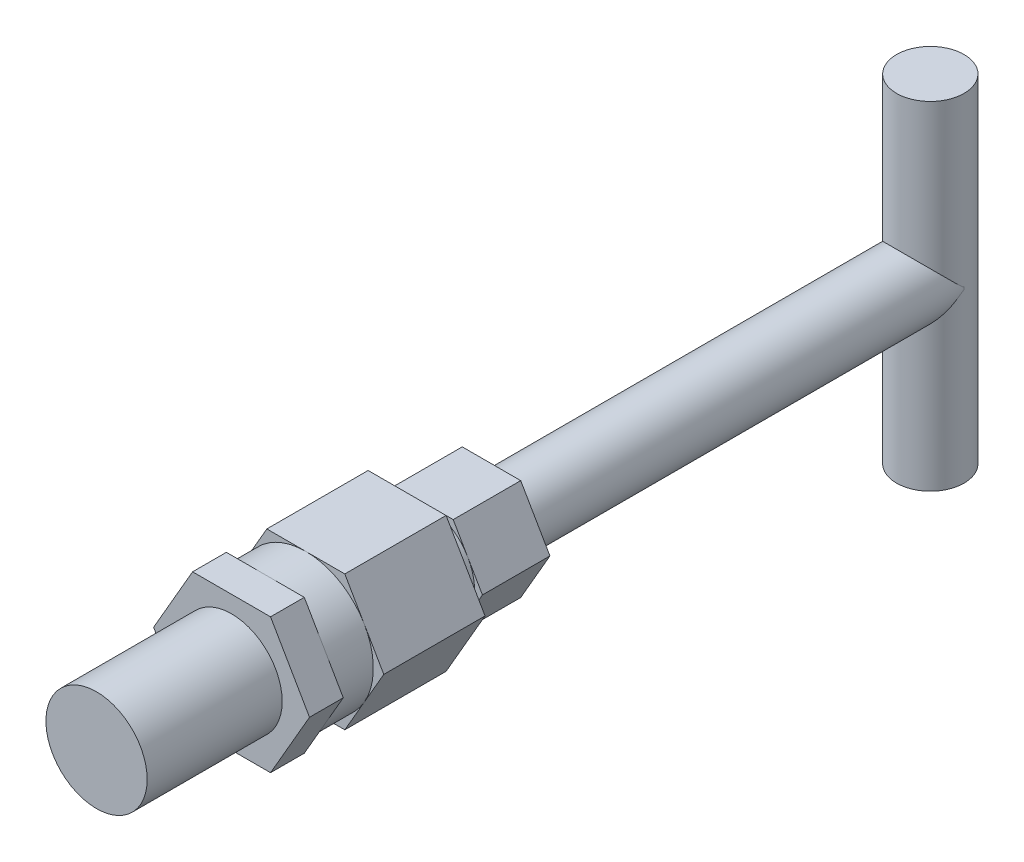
ISO-10303-21;
HEADER;
FILE_DESCRIPTION(('STEP AP214'),'2;1');
FILE_NAME('part.step','',(''),(''),'','','');
FILE_SCHEMA(('AUTOMOTIVE_DESIGN { 1 0 10303 214 1 1 1 1 }'));
ENDSEC;
DATA;
#1=APPLICATION_CONTEXT('core data for automotive mechanical design processes');
#2=APPLICATION_PROTOCOL_DEFINITION('international standard','automotive_design',2000,#1);
#3=PRODUCT_CONTEXT('',#1,'mechanical');
#4=PRODUCT('Part','Part','',(#3));
#5=PRODUCT_RELATED_PRODUCT_CATEGORY('part','',(#4));
#6=PRODUCT_DEFINITION_FORMATION('','',#4);
#7=PRODUCT_DEFINITION_CONTEXT('part definition',#1,'design');
#8=PRODUCT_DEFINITION('design','',#6,#7);
#9=PRODUCT_DEFINITION_SHAPE('','',#8);
#10=(LENGTH_UNIT() NAMED_UNIT(*) SI_UNIT(.MILLI.,.METRE.));
#11=(NAMED_UNIT(*) PLANE_ANGLE_UNIT() SI_UNIT($,.RADIAN.));
#12=(NAMED_UNIT(*) SI_UNIT($,.STERADIAN.) SOLID_ANGLE_UNIT());
#13=UNCERTAINTY_MEASURE_WITH_UNIT(LENGTH_MEASURE(1.E-05),#10,'distance_accuracy_value','');
#14=(GEOMETRIC_REPRESENTATION_CONTEXT(3) GLOBAL_UNCERTAINTY_ASSIGNED_CONTEXT((#13)) GLOBAL_UNIT_ASSIGNED_CONTEXT((#10,
#11,#12)) REPRESENTATION_CONTEXT('',''));
#15=CARTESIAN_POINT('',(0.,0.,0.));
#16=DIRECTION('',(0.,0.,1.));
#17=DIRECTION('',(1.,0.,0.));
#18=AXIS2_PLACEMENT_3D('',#15,#16,#17);
#19=CARTESIAN_POINT('',(0.,0.,-34.));
#20=DIRECTION('',(0.,0.,1.));
#21=DIRECTION('',(1.,0.,0.));
#22=AXIS2_PLACEMENT_3D('',#19,#20,#21);
#23=CYLINDRICAL_SURFACE('',#22,2.);
#24=CARTESIAN_POINT('',(0.,0.,-8.));
#25=DIRECTION('',(0.,0.,-1.));
#26=DIRECTION('',(-1.,0.,0.));
#27=AXIS2_PLACEMENT_3D('',#24,#25,#26);
#28=CIRCLE('',#27,2.);
#29=CARTESIAN_POINT('',(-2.,0.,-8.));
#30=VERTEX_POINT('',#29);
#31=EDGE_CURVE('E234',#30,#30,#28,.T.);
#32=ORIENTED_EDGE('',*,*,#31,.T.);
#33=EDGE_LOOP('',(#32));
#34=FACE_BOUND('',#33,.T.);
#35=CARTESIAN_POINT('',(-1.99809491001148,0.0872738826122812,-34.));
#36=CARTESIAN_POINT('',(-1.9980958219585,0.0872323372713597,-33.9934277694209));
#37=CARTESIAN_POINT('',(-1.9980626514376,0.088014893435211,-33.9869364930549));
#38=CARTESIAN_POINT('',(-1.99793984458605,0.0907699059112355,-33.9743696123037));
#39=CARTESIAN_POINT('',(-1.99785164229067,0.0927120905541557,-33.9682876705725));
#40=CARTESIAN_POINT('',(-1.9974877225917,0.100339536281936,-33.9489046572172));
#41=CARTESIAN_POINT('',(-1.99711635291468,0.107638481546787,-33.9362962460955));
#42=CARTESIAN_POINT('',(-1.99618551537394,0.123749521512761,-33.9118049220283));
#43=CARTESIAN_POINT('',(-1.99562174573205,0.132593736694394,-33.8999466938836));
#44=CARTESIAN_POINT('',(-1.99350688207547,0.162323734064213,-33.8621383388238));
#45=CARTESIAN_POINT('',(-1.99160383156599,0.184411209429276,-33.8371499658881));
#46=CARTESIAN_POINT('',(-1.9869510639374,0.229232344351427,-33.787838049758));
#47=CARTESIAN_POINT('',(-1.98419994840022,0.251967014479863,-33.7635156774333));
#48=CARTESIAN_POINT('',(-1.97788220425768,0.29749193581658,-33.7154870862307));
#49=CARTESIAN_POINT('',(-1.97432419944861,0.320279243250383,-33.6917771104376));
#50=CARTESIAN_POINT('',(-1.9663776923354,0.365919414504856,-33.6445952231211));
#51=CARTESIAN_POINT('',(-1.96198967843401,0.388772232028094,-33.6211231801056));
#52=CARTESIAN_POINT('',(-1.94237848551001,0.482009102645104,-33.5256953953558));
#53=CARTESIAN_POINT('',(-1.92360066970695,0.552399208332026,-33.4544311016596));
#54=CARTESIAN_POINT('',(-1.87787446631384,0.69210343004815,-33.3133676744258));
#55=CARTESIAN_POINT('',(-1.85091893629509,0.761416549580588,-33.2435698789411));
#56=CARTESIAN_POINT('',(-1.78842588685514,0.89845371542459,-33.1057628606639));
#57=CARTESIAN_POINT('',(-1.75286113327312,0.966171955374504,-33.0377600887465));
#58=CARTESIAN_POINT('',(-1.67283034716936,1.09892801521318,-32.904529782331));
#59=CARTESIAN_POINT('',(-1.62837120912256,1.16396786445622,-32.8393001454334));
#60=CARTESIAN_POINT('',(-1.51885898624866,1.30489360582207,-32.6980160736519));
#61=CARTESIAN_POINT('',(-1.45142177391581,1.37987851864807,-32.6228772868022));
#62=CARTESIAN_POINT('',(-1.30165997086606,1.52193832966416,-32.4805602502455));
#63=CARTESIAN_POINT('',(-1.21936913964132,1.58903060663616,-32.4133645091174));
#64=CARTESIAN_POINT('',(-1.05688138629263,1.70021379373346,-32.3020255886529));
#65=CARTESIAN_POINT('',(-0.979360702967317,1.74624335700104,-32.255937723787));
#66=CARTESIAN_POINT('',(-0.81473886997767,1.82883801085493,-32.1732444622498));
#67=CARTESIAN_POINT('',(-0.727648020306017,1.8654131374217,-32.1366290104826));
#68=CARTESIAN_POINT('',(-0.560765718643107,1.92143940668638,-32.0805432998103));
#69=CARTESIAN_POINT('',(-0.482222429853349,1.94273866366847,-32.0592224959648));
#70=CARTESIAN_POINT('',(-0.321186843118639,1.97574746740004,-32.0261808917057));
#71=CARTESIAN_POINT('',(-0.238697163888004,1.98746328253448,-32.0144538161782));
#72=CARTESIAN_POINT('',(-0.0717971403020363,2.00046767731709,-32.0014369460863));
#73=CARTESIAN_POINT('',(0.0126185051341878,2.00172277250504,-32.0001806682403));
#74=CARTESIAN_POINT('',(0.180419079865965,1.99361657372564,-32.0082946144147));
#75=CARTESIAN_POINT('',(0.263803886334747,1.98425402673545,-32.0176660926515));
#76=CARTESIAN_POINT('',(0.423167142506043,1.95631513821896,-32.0456324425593));
#77=CARTESIAN_POINT('',(0.499309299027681,1.93819674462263,-32.0637688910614));
#78=CARTESIAN_POINT('',(0.646834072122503,1.89408134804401,-32.1079301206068));
#79=CARTESIAN_POINT('',(0.718215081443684,1.8680817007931,-32.1339575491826));
#80=CARTESIAN_POINT('',(0.88167117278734,1.7981402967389,-32.2039778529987));
#81=CARTESIAN_POINT('',(0.971131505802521,1.75114471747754,-32.2510294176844));
#82=CARTESIAN_POINT('',(1.13813777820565,1.64752903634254,-32.3547819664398));
#83=CARTESIAN_POINT('',(1.21565510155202,1.59088648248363,-32.4115054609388));
#84=CARTESIAN_POINT('',(1.38552702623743,1.44804043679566,-32.5545842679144));
#85=CARTESIAN_POINT('',(1.47257905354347,1.35870673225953,-32.6440849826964));
#86=CARTESIAN_POINT('',(1.62538524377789,1.17163261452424,-32.8316031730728));
#87=CARTESIAN_POINT('',(1.69114138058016,1.07389298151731,-32.9296198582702));
#88=CARTESIAN_POINT('',(1.77976191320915,0.914853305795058,-33.0893044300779));
#89=CARTESIAN_POINT('',(1.80910519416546,0.855250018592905,-33.1491902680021));
#90=CARTESIAN_POINT('',(1.86133549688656,0.734676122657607,-33.2704938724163));
#91=CARTESIAN_POINT('',(1.88421813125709,0.673704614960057,-33.3319126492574));
#92=CARTESIAN_POINT('',(1.91704290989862,0.571641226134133,-33.4350305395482));
#93=CARTESIAN_POINT('',(1.92874754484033,0.530771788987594,-33.4764025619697));
#94=CARTESIAN_POINT('',(1.9493770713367,0.449100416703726,-33.5593969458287));
#95=CARTESIAN_POINT('',(1.95831834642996,0.408299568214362,-33.6010162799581));
#96=CARTESIAN_POINT('',(1.97043305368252,0.343499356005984,-33.6677183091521));
#97=CARTESIAN_POINT('',(1.97446967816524,0.319454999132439,-33.6926006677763));
#98=CARTESIAN_POINT('',(1.98168535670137,0.271169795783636,-33.7431559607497));
#99=CARTESIAN_POINT('',(1.98484765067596,0.246933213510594,-33.7688350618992));
#100=CARTESIAN_POINT('',(1.99028429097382,0.198404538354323,-33.821457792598));
#101=CARTESIAN_POINT('',(1.99253583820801,0.174124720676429,-33.8484169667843));
#102=CARTESIAN_POINT('',(1.99510716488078,0.140259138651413,-33.8899478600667));
#103=CARTESIAN_POINT('',(1.99582231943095,0.12960609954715,-33.903658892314));
#104=CARTESIAN_POINT('',(1.99699610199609,0.109979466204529,-33.9322249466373));
#105=CARTESIAN_POINT('',(1.99745799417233,0.100985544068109,-33.9470624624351));
#106=CARTESIAN_POINT('',(1.99780710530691,0.0936400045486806,-33.9659674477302));
#107=CARTESIAN_POINT('',(1.99785534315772,0.0926010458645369,-33.9689166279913));
#108=CARTESIAN_POINT('',(1.99793937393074,0.0907690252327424,-33.9748903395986));
#109=CARTESIAN_POINT('',(1.99797517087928,0.089975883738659,-33.9779148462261));
#110=CARTESIAN_POINT('',(1.99806375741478,0.0879940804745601,-33.9872104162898));
#111=CARTESIAN_POINT('',(1.99809531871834,0.0872559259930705,-33.9935769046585));
#112=CARTESIAN_POINT('',(1.99809491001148,0.0872738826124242,-34.0000000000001));
#113=B_SPLINE_CURVE_WITH_KNOTS('',3,(#35,#36,#37,#38,#39,#40,#41,#42,#43,#44,#45,#46,#47,#48,
#49,#50,#51,#52,#53,#54,#55,#56,#57,#58,#59,#60,#61,#62,#63,#64,#65,#66,#67,#68,#69,#70,#71,#72,
#73,#74,#75,#76,#77,#78,#79,#80,#81,#82,#83,#84,#85,#86,#87,#88,#89,#90,#91,#92,#93,#94,#95,#96,
#97,#98,#99,#100,#101,#102,#103,#104,#105,#106,#107,#108,#109,#110,#111,#112),.UNSPECIFIED.,.F.,
.F.,(4,2,2,2,2,2,2,2,2,2,2,2,2,2,2,2,2,2,2,2,2,2,2,2,2,2,2,2,2,2,2,2,2,2,2,2,2,2,4),(0.,
0.0195438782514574,0.0385986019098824,0.0819712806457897,0.126385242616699,0.226453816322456,
0.326688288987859,0.425898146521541,0.525049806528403,0.830412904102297,1.13604347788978,
1.4426538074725,1.7490273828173,2.12513746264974,2.50040323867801,2.80305185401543,
3.10537787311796,3.35668790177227,3.60783342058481,3.85978254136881,4.11176139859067,
4.35179200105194,4.59190322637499,4.92446790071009,5.25781742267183,5.71590842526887,
6.17395695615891,6.44205919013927,6.71034305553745,6.888248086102,7.06507716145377,
7.16956599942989,7.27593729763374,7.38482739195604,7.43700845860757,7.48850015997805,
7.49787146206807,7.50723972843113,7.52638070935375),.UNSPECIFIED.);
#114=CARTESIAN_POINT('',(-1.99809491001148,0.0872738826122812,-34.));
#115=VERTEX_POINT('',#114);
#116=CARTESIAN_POINT('',(1.99809491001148,0.0872738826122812,-34.));
#117=VERTEX_POINT('',#116);
#118=EDGE_CURVE('E227',#115,#117,#113,.T.);
#119=ORIENTED_EDGE('',*,*,#118,.F.);
#120=CARTESIAN_POINT('',(-1.99809491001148,-0.0872738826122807,-34.));
#121=DIRECTION('',(0.,1.,0.));
#122=VECTOR('',#121,1.);
#123=LINE('',#120,#122);
#124=CARTESIAN_POINT('',(-1.99809491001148,-0.0872738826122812,-34.));
#125=VERTEX_POINT('',#124);
#126=EDGE_CURVE('E49',#125,#115,#123,.T.);
#127=ORIENTED_EDGE('',*,*,#126,.F.);
#128=CARTESIAN_POINT('',(1.99809491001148,-0.0872738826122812,-34.));
#129=CARTESIAN_POINT('',(1.9980958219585,-0.0872323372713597,-33.9934277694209));
#130=CARTESIAN_POINT('',(1.9980626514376,-0.088014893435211,-33.9869364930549));
#131=CARTESIAN_POINT('',(1.99793984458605,-0.0907699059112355,-33.9743696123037));
#132=CARTESIAN_POINT('',(1.99785164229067,-0.0927120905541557,-33.9682876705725));
#133=CARTESIAN_POINT('',(1.9974877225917,-0.100339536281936,-33.9489046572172));
#134=CARTESIAN_POINT('',(1.99711635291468,-0.107638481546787,-33.9362962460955));
#135=CARTESIAN_POINT('',(1.99618551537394,-0.123749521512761,-33.9118049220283));
#136=CARTESIAN_POINT('',(1.99562174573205,-0.132593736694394,-33.8999466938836));
#137=CARTESIAN_POINT('',(1.99350688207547,-0.162323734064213,-33.8621383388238));
#138=CARTESIAN_POINT('',(1.99160383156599,-0.184411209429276,-33.8371499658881));
#139=CARTESIAN_POINT('',(1.9869510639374,-0.229232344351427,-33.787838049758));
#140=CARTESIAN_POINT('',(1.98419994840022,-0.251967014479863,-33.7635156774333));
#141=CARTESIAN_POINT('',(1.97788220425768,-0.29749193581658,-33.7154870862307));
#142=CARTESIAN_POINT('',(1.97432419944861,-0.320279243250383,-33.6917771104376));
#143=CARTESIAN_POINT('',(1.9663776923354,-0.365919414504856,-33.6445952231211));
#144=CARTESIAN_POINT('',(1.96198967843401,-0.388772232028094,-33.6211231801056));
#145=CARTESIAN_POINT('',(1.94237848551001,-0.482009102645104,-33.5256953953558));
#146=CARTESIAN_POINT('',(1.92360066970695,-0.552399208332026,-33.4544311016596));
#147=CARTESIAN_POINT('',(1.87787446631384,-0.69210343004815,-33.3133676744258));
#148=CARTESIAN_POINT('',(1.85091893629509,-0.761416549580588,-33.2435698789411));
#149=CARTESIAN_POINT('',(1.78842588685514,-0.89845371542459,-33.1057628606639));
#150=CARTESIAN_POINT('',(1.75286113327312,-0.966171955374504,-33.0377600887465));
#151=CARTESIAN_POINT('',(1.67283034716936,-1.09892801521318,-32.904529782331));
#152=CARTESIAN_POINT('',(1.62837120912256,-1.16396786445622,-32.8393001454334));
#153=CARTESIAN_POINT('',(1.51885898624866,-1.30489360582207,-32.6980160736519));
#154=CARTESIAN_POINT('',(1.45142177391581,-1.37987851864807,-32.6228772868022));
#155=CARTESIAN_POINT('',(1.30165997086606,-1.52193832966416,-32.4805602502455));
#156=CARTESIAN_POINT('',(1.21936913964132,-1.58903060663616,-32.4133645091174));
#157=CARTESIAN_POINT('',(1.05688138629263,-1.70021379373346,-32.3020255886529));
#158=CARTESIAN_POINT('',(0.979360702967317,-1.74624335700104,-32.255937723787));
#159=CARTESIAN_POINT('',(0.81473886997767,-1.82883801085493,-32.1732444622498));
#160=CARTESIAN_POINT('',(0.727648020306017,-1.8654131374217,-32.1366290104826));
#161=CARTESIAN_POINT('',(0.560765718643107,-1.92143940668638,-32.0805432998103));
#162=CARTESIAN_POINT('',(0.482222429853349,-1.94273866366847,-32.0592224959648));
#163=CARTESIAN_POINT('',(0.321186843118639,-1.97574746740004,-32.0261808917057));
#164=CARTESIAN_POINT('',(0.238697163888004,-1.98746328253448,-32.0144538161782));
#165=CARTESIAN_POINT('',(0.0717971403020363,-2.00046767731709,-32.0014369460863));
#166=CARTESIAN_POINT('',(-0.0126185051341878,-2.00172277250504,-32.0001806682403));
#167=CARTESIAN_POINT('',(-0.180419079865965,-1.99361657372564,-32.0082946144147));
#168=CARTESIAN_POINT('',(-0.263803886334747,-1.98425402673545,-32.0176660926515));
#169=CARTESIAN_POINT('',(-0.423167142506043,-1.95631513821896,-32.0456324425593));
#170=CARTESIAN_POINT('',(-0.499309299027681,-1.93819674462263,-32.0637688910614));
#171=CARTESIAN_POINT('',(-0.646834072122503,-1.89408134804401,-32.1079301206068));
#172=CARTESIAN_POINT('',(-0.718215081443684,-1.8680817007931,-32.1339575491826));
#173=CARTESIAN_POINT('',(-0.88167117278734,-1.7981402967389,-32.2039778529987));
#174=CARTESIAN_POINT('',(-0.971131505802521,-1.75114471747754,-32.2510294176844));
#175=CARTESIAN_POINT('',(-1.13813777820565,-1.64752903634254,-32.3547819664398));
#176=CARTESIAN_POINT('',(-1.21565510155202,-1.59088648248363,-32.4115054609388));
#177=CARTESIAN_POINT('',(-1.38552702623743,-1.44804043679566,-32.5545842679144));
#178=CARTESIAN_POINT('',(-1.47257905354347,-1.35870673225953,-32.6440849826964));
#179=CARTESIAN_POINT('',(-1.62538524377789,-1.17163261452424,-32.8316031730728));
#180=CARTESIAN_POINT('',(-1.69114138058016,-1.07389298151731,-32.9296198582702));
#181=CARTESIAN_POINT('',(-1.77976191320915,-0.914853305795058,-33.0893044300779));
#182=CARTESIAN_POINT('',(-1.80910519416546,-0.855250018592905,-33.1491902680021));
#183=CARTESIAN_POINT('',(-1.86133549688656,-0.734676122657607,-33.2704938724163));
#184=CARTESIAN_POINT('',(-1.88421813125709,-0.673704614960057,-33.3319126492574));
#185=CARTESIAN_POINT('',(-1.91704290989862,-0.571641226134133,-33.4350305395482));
#186=CARTESIAN_POINT('',(-1.92874754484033,-0.530771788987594,-33.4764025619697));
#187=CARTESIAN_POINT('',(-1.9493770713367,-0.449100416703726,-33.5593969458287));
#188=CARTESIAN_POINT('',(-1.95831834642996,-0.408299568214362,-33.6010162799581));
#189=CARTESIAN_POINT('',(-1.97043305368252,-0.343499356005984,-33.6677183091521));
#190=CARTESIAN_POINT('',(-1.97446967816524,-0.319454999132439,-33.6926006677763));
#191=CARTESIAN_POINT('',(-1.98168535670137,-0.271169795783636,-33.7431559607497));
#192=CARTESIAN_POINT('',(-1.98484765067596,-0.246933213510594,-33.7688350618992));
#193=CARTESIAN_POINT('',(-1.99028429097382,-0.198404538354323,-33.821457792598));
#194=CARTESIAN_POINT('',(-1.99253583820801,-0.174124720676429,-33.8484169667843));
#195=CARTESIAN_POINT('',(-1.99510716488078,-0.140259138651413,-33.8899478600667));
#196=CARTESIAN_POINT('',(-1.99582231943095,-0.12960609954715,-33.903658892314));
#197=CARTESIAN_POINT('',(-1.99699610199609,-0.109979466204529,-33.9322249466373));
#198=CARTESIAN_POINT('',(-1.99745799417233,-0.100985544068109,-33.9470624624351));
#199=CARTESIAN_POINT('',(-1.99780710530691,-0.0936400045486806,-33.9659674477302));
#200=CARTESIAN_POINT('',(-1.99785534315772,-0.0926010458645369,-33.9689166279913));
#201=CARTESIAN_POINT('',(-1.99793937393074,-0.0907690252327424,-33.9748903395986));
#202=CARTESIAN_POINT('',(-1.99797517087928,-0.089975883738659,-33.9779148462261));
#203=CARTESIAN_POINT('',(-1.99806375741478,-0.0879940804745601,-33.9872104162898));
#204=CARTESIAN_POINT('',(-1.99809531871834,-0.0872559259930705,-33.9935769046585));
#205=CARTESIAN_POINT('',(-1.99809491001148,-0.0872738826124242,-34.0000000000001));
#206=B_SPLINE_CURVE_WITH_KNOTS('',3,(#128,#129,#130,#131,#132,#133,#134,#135,#136,#137,#138,
#139,#140,#141,#142,#143,#144,#145,#146,#147,#148,#149,#150,#151,#152,#153,#154,#155,#156,#157,
#158,#159,#160,#161,#162,#163,#164,#165,#166,#167,#168,#169,#170,#171,#172,#173,#174,#175,#176,
#177,#178,#179,#180,#181,#182,#183,#184,#185,#186,#187,#188,#189,#190,#191,#192,#193,#194,#195,
#196,#197,#198,#199,#200,#201,#202,#203,#204,#205),.UNSPECIFIED.,.F.,.F.,(4,2,2,2,2,2,2,2,2,2,2,
2,2,2,2,2,2,2,2,2,2,2,2,2,2,2,2,2,2,2,2,2,2,2,2,2,2,2,4),(0.,0.0195438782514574,
0.0385986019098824,0.0819712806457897,0.126385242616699,0.226453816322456,0.326688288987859,
0.425898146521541,0.525049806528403,0.830412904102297,1.13604347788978,1.4426538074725,
1.7490273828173,2.12513746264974,2.50040323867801,2.80305185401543,3.10537787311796,
3.35668790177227,3.60783342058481,3.85978254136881,4.11176139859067,4.35179200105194,
4.59190322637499,4.92446790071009,5.25781742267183,5.71590842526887,6.17395695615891,
6.44205919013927,6.71034305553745,6.888248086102,7.06507716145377,7.16956599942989,
7.27593729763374,7.38482739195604,7.43700845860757,7.48850015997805,7.49787146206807,
7.50723972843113,7.52638070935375),.UNSPECIFIED.);
#207=CARTESIAN_POINT('',(1.99809491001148,-0.0872738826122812,-34.));
#208=VERTEX_POINT('',#207);
#209=EDGE_CURVE('E60',#208,#125,#206,.T.);
#210=ORIENTED_EDGE('',*,*,#209,.F.);
#211=CARTESIAN_POINT('',(1.99809491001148,0.0872738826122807,-34.));
#212=DIRECTION('',(0.,-1.,0.));
#213=VECTOR('',#212,1.);
#214=LINE('',#211,#213);
#215=EDGE_CURVE('E11',#117,#208,#214,.T.);
#216=ORIENTED_EDGE('',*,*,#215,.F.);
#217=EDGE_LOOP('',(#119,#127,#210,#216));
#218=FACE_BOUND('',#217,.T.);
#219=ADVANCED_FACE('F38',(#34,#218),#23,.T.);
#220=CARTESIAN_POINT('',(0.,0.,3.));
#221=DIRECTION('',(0.,0.,1.));
#222=DIRECTION('',(1.,0.,0.));
#223=AXIS2_PLACEMENT_3D('',#220,#221,#222);
#224=PLANE('',#223);
#225=CARTESIAN_POINT('',(0.,0.,3.));
#226=DIRECTION('',(0.,0.,1.));
#227=DIRECTION('',(1.,0.,0.));
#228=AXIS2_PLACEMENT_3D('',#225,#226,#227);
#229=CIRCLE('',#228,4.);
#230=CARTESIAN_POINT('',(3.46410161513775,2.,3.));
#231=VERTEX_POINT('',#230);
#232=CARTESIAN_POINT('',(0.,4.,3.));
#233=VERTEX_POINT('',#232);
#234=EDGE_CURVE('E406',#231,#233,#229,.T.);
#235=ORIENTED_EDGE('',*,*,#234,.F.);
#236=DIRECTION('',(-0.5,0.866025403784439,0.));
#237=VECTOR('',#236,1.);
#238=CARTESIAN_POINT('',(4.61880215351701,0.,3.));
#239=LINE('',#238,#237);
#240=CARTESIAN_POINT('',(2.3094010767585,4.,3.));
#241=VERTEX_POINT('',#240);
#242=EDGE_CURVE('E419',#231,#241,#239,.T.);
#243=ORIENTED_EDGE('',*,*,#242,.T.);
#244=DIRECTION('',(-1.,0.,0.));
#245=VECTOR('',#244,1.);
#246=CARTESIAN_POINT('',(2.3094010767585,4.,3.));
#247=LINE('',#246,#245);
#248=EDGE_CURVE('E420',#241,#233,#247,.T.);
#249=ORIENTED_EDGE('',*,*,#248,.T.);
#250=EDGE_LOOP('',(#235,#243,#249));
#251=FACE_BOUND('',#250,.T.);
#252=ADVANCED_FACE('F497',(#251),#224,.T.);
#253=CARTESIAN_POINT('',(-3.46410161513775,2.,3.));
#254=VERTEX_POINT('',#253);
#255=EDGE_CURVE('E351',#233,#254,#229,.T.);
#256=ORIENTED_EDGE('',*,*,#255,.F.);
#257=CARTESIAN_POINT('',(-2.3094010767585,4.,3.));
#258=VERTEX_POINT('',#257);
#259=EDGE_CURVE('E418',#233,#258,#247,.T.);
#260=ORIENTED_EDGE('',*,*,#259,.T.);
#261=DIRECTION('',(-0.5,-0.866025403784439,0.));
#262=VECTOR('',#261,1.);
#263=CARTESIAN_POINT('',(-2.3094010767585,4.,3.));
#264=LINE('',#263,#262);
#265=EDGE_CURVE('E424',#258,#254,#264,.T.);
#266=ORIENTED_EDGE('',*,*,#265,.T.);
#267=EDGE_LOOP('',(#256,#260,#266));
#268=FACE_BOUND('',#267,.T.);
#269=ADVANCED_FACE('F492',(#268),#224,.T.);
#270=CARTESIAN_POINT('',(-3.46410161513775,-2.,3.));
#271=VERTEX_POINT('',#270);
#272=EDGE_CURVE('E485',#254,#271,#229,.T.);
#273=ORIENTED_EDGE('',*,*,#272,.F.);
#274=CARTESIAN_POINT('',(-4.61880215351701,0.,3.));
#275=VERTEX_POINT('',#274);
#276=EDGE_CURVE('E423',#254,#275,#264,.T.);
#277=ORIENTED_EDGE('',*,*,#276,.T.);
#278=DIRECTION('',(0.5,-0.866025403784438,0.));
#279=VECTOR('',#278,1.);
#280=CARTESIAN_POINT('',(-4.61880215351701,0.,3.));
#281=LINE('',#280,#279);
#282=EDGE_CURVE('E428',#275,#271,#281,.T.);
#283=ORIENTED_EDGE('',*,*,#282,.T.);
#284=EDGE_LOOP('',(#273,#277,#283));
#285=FACE_BOUND('',#284,.T.);
#286=ADVANCED_FACE('F515',(#285),#224,.T.);
#287=CARTESIAN_POINT('',(0.,-4.,3.));
#288=VERTEX_POINT('',#287);
#289=EDGE_CURVE('E483',#271,#288,#229,.T.);
#290=ORIENTED_EDGE('',*,*,#289,.F.);
#291=CARTESIAN_POINT('',(-2.3094010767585,-4.,3.));
#292=VERTEX_POINT('',#291);
#293=EDGE_CURVE('E427',#271,#292,#281,.T.);
#294=ORIENTED_EDGE('',*,*,#293,.T.);
#295=DIRECTION('',(1.,0.,0.));
#296=VECTOR('',#295,1.);
#297=CARTESIAN_POINT('',(-2.3094010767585,-4.,3.));
#298=LINE('',#297,#296);
#299=EDGE_CURVE('E432',#292,#288,#298,.T.);
#300=ORIENTED_EDGE('',*,*,#299,.T.);
#301=EDGE_LOOP('',(#290,#294,#300));
#302=FACE_BOUND('',#301,.T.);
#303=ADVANCED_FACE('F522',(#302),#224,.T.);
#304=CARTESIAN_POINT('',(3.46410161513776,-2.,3.));
#305=VERTEX_POINT('',#304);
#306=EDGE_CURVE('E480',#288,#305,#229,.T.);
#307=ORIENTED_EDGE('',*,*,#306,.F.);
#308=CARTESIAN_POINT('',(2.30940107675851,-4.,3.));
#309=VERTEX_POINT('',#308);
#310=EDGE_CURVE('E431',#288,#309,#298,.T.);
#311=ORIENTED_EDGE('',*,*,#310,.T.);
#312=DIRECTION('',(0.5,0.866025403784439,0.));
#313=VECTOR('',#312,1.);
#314=CARTESIAN_POINT('',(2.30940107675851,-4.,3.));
#315=LINE('',#314,#313);
#316=EDGE_CURVE('E436',#309,#305,#315,.T.);
#317=ORIENTED_EDGE('',*,*,#316,.T.);
#318=EDGE_LOOP('',(#307,#311,#317));
#319=FACE_BOUND('',#318,.T.);
#320=ADVANCED_FACE('F529',(#319),#224,.T.);
#321=CARTESIAN_POINT('',(4.61880215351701,0.,3.));
#322=DIRECTION('',(-0.866025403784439,-0.5,0.));
#323=DIRECTION('',(0.5,-0.866025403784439,0.));
#324=AXIS2_PLACEMENT_3D('',#321,#322,#323);
#325=PLANE('',#324);
#326=DIRECTION('',(-0.5,0.866025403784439,0.));
#327=VECTOR('',#326,1.);
#328=CARTESIAN_POINT('',(4.61880215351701,0.,-3.));
#329=LINE('',#328,#327);
#330=CARTESIAN_POINT('',(4.61880215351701,0.,-3.));
#331=VERTEX_POINT('',#330);
#332=CARTESIAN_POINT('',(2.3094010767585,4.,-3.));
#333=VERTEX_POINT('',#332);
#334=EDGE_CURVE('E410',#331,#333,#329,.T.);
#335=ORIENTED_EDGE('',*,*,#334,.T.);
#336=DIRECTION('',(0.,0.,-1.));
#337=VECTOR('',#336,1.);
#338=CARTESIAN_POINT('',(2.3094010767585,4.,3.));
#339=LINE('',#338,#337);
#340=EDGE_CURVE('E466',#241,#333,#339,.T.);
#341=ORIENTED_EDGE('',*,*,#340,.F.);
#342=ORIENTED_EDGE('',*,*,#242,.F.);
#343=CARTESIAN_POINT('',(4.61880215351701,0.,3.));
#344=VERTEX_POINT('',#343);
#345=EDGE_CURVE('E416',#344,#231,#239,.T.);
#346=ORIENTED_EDGE('',*,*,#345,.F.);
#347=DIRECTION('',(0.,0.,-1.));
#348=VECTOR('',#347,1.);
#349=CARTESIAN_POINT('',(4.61880215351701,0.,3.));
#350=LINE('',#349,#348);
#351=EDGE_CURVE('E439',#344,#331,#350,.T.);
#352=ORIENTED_EDGE('',*,*,#351,.T.);
#353=EDGE_LOOP('',(#335,#341,#342,#346,#352));
#354=FACE_BOUND('',#353,.T.);
#355=ADVANCED_FACE('F40',(#354),#325,.F.);
#356=CARTESIAN_POINT('',(2.3094010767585,4.,3.));
#357=DIRECTION('',(0.,-1.,0.));
#358=DIRECTION('',(0.,0.,-1.));
#359=AXIS2_PLACEMENT_3D('',#356,#357,#358);
#360=PLANE('',#359);
#361=DIRECTION('',(-1.,0.,0.));
#362=VECTOR('',#361,1.);
#363=CARTESIAN_POINT('',(2.3094010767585,4.,-3.));
#364=LINE('',#363,#362);
#365=CARTESIAN_POINT('',(-2.3094010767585,4.,-3.));
#366=VERTEX_POINT('',#365);
#367=EDGE_CURVE('E442',#333,#366,#364,.T.);
#368=ORIENTED_EDGE('',*,*,#367,.T.);
#369=DIRECTION('',(0.,0.,-1.));
#370=VECTOR('',#369,1.);
#371=CARTESIAN_POINT('',(-2.3094010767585,4.,3.));
#372=LINE('',#371,#370);
#373=EDGE_CURVE('E463',#258,#366,#372,.T.);
#374=ORIENTED_EDGE('',*,*,#373,.F.);
#375=ORIENTED_EDGE('',*,*,#259,.F.);
#376=ORIENTED_EDGE('',*,*,#248,.F.);
#377=ORIENTED_EDGE('',*,*,#340,.T.);
#378=EDGE_LOOP('',(#368,#374,#375,#376,#377));
#379=FACE_BOUND('',#378,.T.);
#380=ADVANCED_FACE('F495',(#379),#360,.F.);
#381=CARTESIAN_POINT('',(-2.3094010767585,4.,3.));
#382=DIRECTION('',(0.866025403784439,-0.5,0.));
#383=DIRECTION('',(0.5,0.866025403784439,0.));
#384=AXIS2_PLACEMENT_3D('',#381,#382,#383);
#385=PLANE('',#384);
#386=DIRECTION('',(-0.5,-0.866025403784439,0.));
#387=VECTOR('',#386,1.);
#388=CARTESIAN_POINT('',(-2.3094010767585,4.,-3.));
#389=LINE('',#388,#387);
#390=CARTESIAN_POINT('',(-4.61880215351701,0.,-3.));
#391=VERTEX_POINT('',#390);
#392=EDGE_CURVE('E444',#366,#391,#389,.T.);
#393=ORIENTED_EDGE('',*,*,#392,.T.);
#394=DIRECTION('',(0.,0.,-1.));
#395=VECTOR('',#394,1.);
#396=CARTESIAN_POINT('',(-4.61880215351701,0.,3.));
#397=LINE('',#396,#395);
#398=EDGE_CURVE('E460',#275,#391,#397,.T.);
#399=ORIENTED_EDGE('',*,*,#398,.F.);
#400=ORIENTED_EDGE('',*,*,#276,.F.);
#401=ORIENTED_EDGE('',*,*,#265,.F.);
#402=ORIENTED_EDGE('',*,*,#373,.T.);
#403=EDGE_LOOP('',(#393,#399,#400,#401,#402));
#404=FACE_BOUND('',#403,.T.);
#405=ADVANCED_FACE('F510',(#404),#385,.F.);
#406=CARTESIAN_POINT('',(-4.61880215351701,0.,3.));
#407=DIRECTION('',(0.866025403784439,0.5,0.));
#408=DIRECTION('',(-0.5,0.866025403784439,0.));
#409=AXIS2_PLACEMENT_3D('',#406,#407,#408);
#410=PLANE('',#409);
#411=DIRECTION('',(0.5,-0.866025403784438,0.));
#412=VECTOR('',#411,1.);
#413=CARTESIAN_POINT('',(-4.61880215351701,0.,-3.));
#414=LINE('',#413,#412);
#415=CARTESIAN_POINT('',(-2.3094010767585,-4.,-3.));
#416=VERTEX_POINT('',#415);
#417=EDGE_CURVE('E446',#391,#416,#414,.T.);
#418=ORIENTED_EDGE('',*,*,#417,.T.);
#419=DIRECTION('',(0.,0.,-1.));
#420=VECTOR('',#419,1.);
#421=CARTESIAN_POINT('',(-2.3094010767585,-4.,3.));
#422=LINE('',#421,#420);
#423=EDGE_CURVE('E457',#292,#416,#422,.T.);
#424=ORIENTED_EDGE('',*,*,#423,.F.);
#425=ORIENTED_EDGE('',*,*,#293,.F.);
#426=ORIENTED_EDGE('',*,*,#282,.F.);
#427=ORIENTED_EDGE('',*,*,#398,.T.);
#428=EDGE_LOOP('',(#418,#424,#425,#426,#427));
#429=FACE_BOUND('',#428,.T.);
#430=ADVANCED_FACE('F518',(#429),#410,.F.);
#431=CARTESIAN_POINT('',(-2.3094010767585,-4.,3.));
#432=DIRECTION('',(0.,1.,0.));
#433=DIRECTION('',(0.,0.,1.));
#434=AXIS2_PLACEMENT_3D('',#431,#432,#433);
#435=PLANE('',#434);
#436=DIRECTION('',(1.,0.,0.));
#437=VECTOR('',#436,1.);
#438=CARTESIAN_POINT('',(-2.3094010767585,-4.,-3.));
#439=LINE('',#438,#437);
#440=CARTESIAN_POINT('',(2.30940107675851,-4.,-3.));
#441=VERTEX_POINT('',#440);
#442=EDGE_CURVE('E448',#416,#441,#439,.T.);
#443=ORIENTED_EDGE('',*,*,#442,.T.);
#444=DIRECTION('',(0.,0.,-1.));
#445=VECTOR('',#444,1.);
#446=CARTESIAN_POINT('',(2.30940107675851,-4.,3.));
#447=LINE('',#446,#445);
#448=EDGE_CURVE('E454',#309,#441,#447,.T.);
#449=ORIENTED_EDGE('',*,*,#448,.F.);
#450=ORIENTED_EDGE('',*,*,#310,.F.);
#451=ORIENTED_EDGE('',*,*,#299,.F.);
#452=ORIENTED_EDGE('',*,*,#423,.T.);
#453=EDGE_LOOP('',(#443,#449,#450,#451,#452));
#454=FACE_BOUND('',#453,.T.);
#455=ADVANCED_FACE('F525',(#454),#435,.F.);
#456=CARTESIAN_POINT('',(2.30940107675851,-4.,3.));
#457=DIRECTION('',(-0.866025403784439,0.5,0.));
#458=DIRECTION('',(-0.5,-0.866025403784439,0.));
#459=AXIS2_PLACEMENT_3D('',#456,#457,#458);
#460=PLANE('',#459);
#461=DIRECTION('',(0.5,0.866025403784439,0.));
#462=VECTOR('',#461,1.);
#463=CARTESIAN_POINT('',(2.30940107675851,-4.,-3.));
#464=LINE('',#463,#462);
#465=EDGE_CURVE('E450',#441,#331,#464,.T.);
#466=ORIENTED_EDGE('',*,*,#465,.T.);
#467=ORIENTED_EDGE('',*,*,#351,.F.);
#468=EDGE_CURVE('E435',#305,#344,#315,.T.);
#469=ORIENTED_EDGE('',*,*,#468,.F.);
#470=ORIENTED_EDGE('',*,*,#316,.F.);
#471=ORIENTED_EDGE('',*,*,#448,.T.);
#472=EDGE_LOOP('',(#466,#467,#469,#470,#471));
#473=FACE_BOUND('',#472,.T.);
#474=ADVANCED_FACE('F532',(#473),#460,.F.);
#475=EDGE_CURVE('E415',#305,#231,#229,.T.);
#476=ORIENTED_EDGE('',*,*,#475,.F.);
#477=ORIENTED_EDGE('',*,*,#468,.T.);
#478=ORIENTED_EDGE('',*,*,#345,.T.);
#479=EDGE_LOOP('',(#476,#477,#478));
#480=FACE_BOUND('',#479,.T.);
#481=ADVANCED_FACE('F534',(#480),#224,.T.);
#482=CARTESIAN_POINT('',(0.,0.,-3.));
#483=DIRECTION('',(0.,0.,1.));
#484=DIRECTION('',(1.,0.,0.));
#485=AXIS2_PLACEMENT_3D('',#482,#483,#484);
#486=PLANE('',#485);
#487=CARTESIAN_POINT('',(0.,0.,-3.));
#488=DIRECTION('',(0.,0.,-1.));
#489=DIRECTION('',(-1.,0.,0.));
#490=AXIS2_PLACEMENT_3D('',#487,#488,#489);
#491=CIRCLE('',#490,3.);
#492=CARTESIAN_POINT('',(-3.,0.,-3.));
#493=VERTEX_POINT('',#492);
#494=EDGE_CURVE('E282',#493,#493,#491,.T.);
#495=ORIENTED_EDGE('',*,*,#494,.F.);
#496=EDGE_LOOP('',(#495));
#497=FACE_BOUND('',#496,.T.);
#498=ORIENTED_EDGE('',*,*,#334,.F.);
#499=ORIENTED_EDGE('',*,*,#465,.F.);
#500=ORIENTED_EDGE('',*,*,#442,.F.);
#501=ORIENTED_EDGE('',*,*,#417,.F.);
#502=ORIENTED_EDGE('',*,*,#392,.F.);
#503=ORIENTED_EDGE('',*,*,#367,.F.);
#504=EDGE_LOOP('',(#498,#499,#500,#501,#502,#503));
#505=FACE_BOUND('',#504,.T.);
#506=ADVANCED_FACE('F505',(#497,#505),#486,.F.);
#507=CARTESIAN_POINT('',(0.,0.,5.4));
#508=DIRECTION('',(0.,0.,-1.));
#509=DIRECTION('',(-1.,0.,0.));
#510=AXIS2_PLACEMENT_3D('',#507,#508,#509);
#511=CYLINDRICAL_SURFACE('',#510,4.);
#512=CARTESIAN_POINT('',(0.,0.,5.4));
#513=DIRECTION('',(0.,0.,1.));
#514=DIRECTION('',(1.,0.,0.));
#515=AXIS2_PLACEMENT_3D('',#512,#513,#514);
#516=CIRCLE('',#515,4.);
#517=CARTESIAN_POINT('',(3.46410161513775,2.,5.4));
#518=VERTEX_POINT('',#517);
#519=CARTESIAN_POINT('',(0.,4.,5.4));
#520=VERTEX_POINT('',#519);
#521=EDGE_CURVE('E407',#518,#520,#516,.T.);
#522=ORIENTED_EDGE('',*,*,#521,.F.);
#523=CARTESIAN_POINT('',(3.46410161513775,-2.,5.4));
#524=VERTEX_POINT('',#523);
#525=EDGE_CURVE('E412',#524,#518,#516,.T.);
#526=ORIENTED_EDGE('',*,*,#525,.F.);
#527=CARTESIAN_POINT('',(0.,-4.,5.4));
#528=VERTEX_POINT('',#527);
#529=EDGE_CURVE('E677',#528,#524,#516,.T.);
#530=ORIENTED_EDGE('',*,*,#529,.F.);
#531=CARTESIAN_POINT('',(-3.46410161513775,-2.,5.4));
#532=VERTEX_POINT('',#531);
#533=EDGE_CURVE('E688',#532,#528,#516,.T.);
#534=ORIENTED_EDGE('',*,*,#533,.F.);
#535=CARTESIAN_POINT('',(-3.46410161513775,2.,5.4));
#536=VERTEX_POINT('',#535);
#537=EDGE_CURVE('E689',#536,#532,#516,.T.);
#538=ORIENTED_EDGE('',*,*,#537,.F.);
#539=EDGE_CURVE('E411',#520,#536,#516,.T.);
#540=ORIENTED_EDGE('',*,*,#539,.F.);
#541=EDGE_LOOP('',(#522,#526,#530,#534,#538,#540));
#542=FACE_BOUND('',#541,.T.);
#543=ORIENTED_EDGE('',*,*,#234,.T.);
#544=ORIENTED_EDGE('',*,*,#255,.T.);
#545=ORIENTED_EDGE('',*,*,#272,.T.);
#546=ORIENTED_EDGE('',*,*,#289,.T.);
#547=ORIENTED_EDGE('',*,*,#306,.T.);
#548=ORIENTED_EDGE('',*,*,#475,.T.);
#549=EDGE_LOOP('',(#543,#544,#545,#546,#547,#548));
#550=FACE_BOUND('',#549,.T.);
#551=ADVANCED_FACE('F488',(#542,#550),#511,.T.);
#552=CARTESIAN_POINT('',(0.,0.,5.4));
#553=DIRECTION('',(0.,0.,1.));
#554=DIRECTION('',(1.,0.,0.));
#555=AXIS2_PLACEMENT_3D('',#552,#553,#554);
#556=PLANE('',#555);
#557=DIRECTION('',(-0.5,0.866025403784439,0.));
#558=VECTOR('',#557,1.);
#559=CARTESIAN_POINT('',(4.61880215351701,0.,5.4));
#560=LINE('',#559,#558);
#561=CARTESIAN_POINT('',(2.3094010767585,4.,5.4));
#562=VERTEX_POINT('',#561);
#563=EDGE_CURVE('E348',#518,#562,#560,.T.);
#564=ORIENTED_EDGE('',*,*,#563,.F.);
#565=ORIENTED_EDGE('',*,*,#521,.T.);
#566=DIRECTION('',(-1.,0.,0.));
#567=VECTOR('',#566,1.);
#568=CARTESIAN_POINT('',(2.3094010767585,4.,5.4));
#569=LINE('',#568,#567);
#570=EDGE_CURVE('E371',#562,#520,#569,.T.);
#571=ORIENTED_EDGE('',*,*,#570,.F.);
#572=EDGE_LOOP('',(#564,#565,#571));
#573=FACE_BOUND('',#572,.T.);
#574=ADVANCED_FACE('F636',(#573),#556,.F.);
#575=CARTESIAN_POINT('',(-2.3094010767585,4.,5.4));
#576=VERTEX_POINT('',#575);
#577=EDGE_CURVE('E370',#520,#576,#569,.T.);
#578=ORIENTED_EDGE('',*,*,#577,.F.);
#579=ORIENTED_EDGE('',*,*,#539,.T.);
#580=DIRECTION('',(-0.5,-0.866025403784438,0.));
#581=VECTOR('',#580,1.);
#582=CARTESIAN_POINT('',(-2.3094010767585,4.,5.4));
#583=LINE('',#582,#581);
#584=EDGE_CURVE('E375',#576,#536,#583,.T.);
#585=ORIENTED_EDGE('',*,*,#584,.F.);
#586=EDGE_LOOP('',(#578,#579,#585));
#587=FACE_BOUND('',#586,.T.);
#588=ADVANCED_FACE('F639',(#587),#556,.F.);
#589=CARTESIAN_POINT('',(-4.61880215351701,0.,5.4));
#590=VERTEX_POINT('',#589);
#591=EDGE_CURVE('E374',#536,#590,#583,.T.);
#592=ORIENTED_EDGE('',*,*,#591,.F.);
#593=ORIENTED_EDGE('',*,*,#537,.T.);
#594=DIRECTION('',(0.5,-0.866025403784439,0.));
#595=VECTOR('',#594,1.);
#596=CARTESIAN_POINT('',(-4.61880215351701,0.,5.4));
#597=LINE('',#596,#595);
#598=EDGE_CURVE('E379',#590,#532,#597,.T.);
#599=ORIENTED_EDGE('',*,*,#598,.F.);
#600=EDGE_LOOP('',(#592,#593,#599));
#601=FACE_BOUND('',#600,.T.);
#602=ADVANCED_FACE('F699',(#601),#556,.F.);
#603=CARTESIAN_POINT('',(-2.3094010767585,-4.,5.4));
#604=VERTEX_POINT('',#603);
#605=EDGE_CURVE('E378',#532,#604,#597,.T.);
#606=ORIENTED_EDGE('',*,*,#605,.F.);
#607=ORIENTED_EDGE('',*,*,#533,.T.);
#608=DIRECTION('',(1.,0.,0.));
#609=VECTOR('',#608,1.);
#610=CARTESIAN_POINT('',(-2.3094010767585,-4.,5.4));
#611=LINE('',#610,#609);
#612=EDGE_CURVE('E383',#604,#528,#611,.T.);
#613=ORIENTED_EDGE('',*,*,#612,.F.);
#614=EDGE_LOOP('',(#606,#607,#613));
#615=FACE_BOUND('',#614,.T.);
#616=ADVANCED_FACE('F707',(#615),#556,.F.);
#617=CARTESIAN_POINT('',(2.3094010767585,-4.,5.4));
#618=VERTEX_POINT('',#617);
#619=EDGE_CURVE('E382',#528,#618,#611,.T.);
#620=ORIENTED_EDGE('',*,*,#619,.F.);
#621=ORIENTED_EDGE('',*,*,#529,.T.);
#622=DIRECTION('',(0.5,0.866025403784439,0.));
#623=VECTOR('',#622,1.);
#624=CARTESIAN_POINT('',(2.3094010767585,-4.,5.4));
#625=LINE('',#624,#623);
#626=EDGE_CURVE('E356',#618,#524,#625,.T.);
#627=ORIENTED_EDGE('',*,*,#626,.F.);
#628=EDGE_LOOP('',(#620,#621,#627));
#629=FACE_BOUND('',#628,.T.);
#630=ADVANCED_FACE('F686',(#629),#556,.F.);
#631=CARTESIAN_POINT('',(4.61880215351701,0.,5.4));
#632=VERTEX_POINT('',#631);
#633=EDGE_CURVE('E386',#524,#632,#625,.T.);
#634=ORIENTED_EDGE('',*,*,#633,.F.);
#635=ORIENTED_EDGE('',*,*,#525,.T.);
#636=EDGE_CURVE('E367',#632,#518,#560,.T.);
#637=ORIENTED_EDGE('',*,*,#636,.F.);
#638=EDGE_LOOP('',(#634,#635,#637));
#639=FACE_BOUND('',#638,.T.);
#640=ADVANCED_FACE('F641',(#639),#556,.F.);
#641=CARTESIAN_POINT('',(4.61880215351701,0.,7.4));
#642=DIRECTION('',(-0.866025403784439,-0.5,0.));
#643=DIRECTION('',(0.5,-0.866025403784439,0.));
#644=AXIS2_PLACEMENT_3D('',#641,#642,#643);
#645=PLANE('',#644);
#646=ORIENTED_EDGE('',*,*,#636,.T.);
#647=ORIENTED_EDGE('',*,*,#563,.T.);
#648=DIRECTION('',(0.,0.,-1.));
#649=VECTOR('',#648,1.);
#650=CARTESIAN_POINT('',(2.3094010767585,4.,7.4));
#651=LINE('',#650,#649);
#652=CARTESIAN_POINT('',(2.3094010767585,4.,7.4));
#653=VERTEX_POINT('',#652);
#654=EDGE_CURVE('E403',#653,#562,#651,.T.);
#655=ORIENTED_EDGE('',*,*,#654,.F.);
#656=DIRECTION('',(-0.5,0.866025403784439,0.));
#657=VECTOR('',#656,1.);
#658=CARTESIAN_POINT('',(4.61880215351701,0.,7.4));
#659=LINE('',#658,#657);
#660=CARTESIAN_POINT('',(4.61880215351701,0.,7.4));
#661=VERTEX_POINT('',#660);
#662=EDGE_CURVE('E352',#661,#653,#659,.T.);
#663=ORIENTED_EDGE('',*,*,#662,.F.);
#664=DIRECTION('',(0.,0.,-1.));
#665=VECTOR('',#664,1.);
#666=CARTESIAN_POINT('',(4.61880215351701,0.,7.4));
#667=LINE('',#666,#665);
#668=EDGE_CURVE('E366',#661,#632,#667,.T.);
#669=ORIENTED_EDGE('',*,*,#668,.T.);
#670=EDGE_LOOP('',(#646,#647,#655,#663,#669));
#671=FACE_BOUND('',#670,.T.);
#672=ADVANCED_FACE('F660',(#671),#645,.F.);
#673=CARTESIAN_POINT('',(2.3094010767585,4.,7.4));
#674=DIRECTION('',(0.,-1.,0.));
#675=DIRECTION('',(1.,0.,0.));
#676=AXIS2_PLACEMENT_3D('',#673,#674,#675);
#677=PLANE('',#676);
#678=ORIENTED_EDGE('',*,*,#570,.T.);
#679=ORIENTED_EDGE('',*,*,#577,.T.);
#680=DIRECTION('',(0.,0.,-1.));
#681=VECTOR('',#680,1.);
#682=CARTESIAN_POINT('',(-2.3094010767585,4.,7.4));
#683=LINE('',#682,#681);
#684=CARTESIAN_POINT('',(-2.3094010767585,4.,7.4));
#685=VERTEX_POINT('',#684);
#686=EDGE_CURVE('E400',#685,#576,#683,.T.);
#687=ORIENTED_EDGE('',*,*,#686,.F.);
#688=DIRECTION('',(-1.,0.,0.));
#689=VECTOR('',#688,1.);
#690=CARTESIAN_POINT('',(2.3094010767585,4.,7.4));
#691=LINE('',#690,#689);
#692=EDGE_CURVE('E355',#653,#685,#691,.T.);
#693=ORIENTED_EDGE('',*,*,#692,.F.);
#694=ORIENTED_EDGE('',*,*,#654,.T.);
#695=EDGE_LOOP('',(#678,#679,#687,#693,#694));
#696=FACE_BOUND('',#695,.T.);
#697=ADVANCED_FACE('F656',(#696),#677,.F.);
#698=CARTESIAN_POINT('',(-2.3094010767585,4.,7.4));
#699=DIRECTION('',(0.866025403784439,-0.5,0.));
#700=DIRECTION('',(0.5,0.866025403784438,0.));
#701=AXIS2_PLACEMENT_3D('',#698,#699,#700);
#702=PLANE('',#701);
#703=ORIENTED_EDGE('',*,*,#584,.T.);
#704=ORIENTED_EDGE('',*,*,#591,.T.);
#705=DIRECTION('',(0.,0.,-1.));
#706=VECTOR('',#705,1.);
#707=CARTESIAN_POINT('',(-4.61880215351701,0.,7.4));
#708=LINE('',#707,#706);
#709=CARTESIAN_POINT('',(-4.61880215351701,0.,7.4));
#710=VERTEX_POINT('',#709);
#711=EDGE_CURVE('E397',#710,#590,#708,.T.);
#712=ORIENTED_EDGE('',*,*,#711,.F.);
#713=DIRECTION('',(-0.5,-0.866025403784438,0.));
#714=VECTOR('',#713,1.);
#715=CARTESIAN_POINT('',(-2.3094010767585,4.,7.4));
#716=LINE('',#715,#714);
#717=EDGE_CURVE('E358',#685,#710,#716,.T.);
#718=ORIENTED_EDGE('',*,*,#717,.F.);
#719=ORIENTED_EDGE('',*,*,#686,.T.);
#720=EDGE_LOOP('',(#703,#704,#712,#718,#719));
#721=FACE_BOUND('',#720,.T.);
#722=ADVANCED_FACE('F652',(#721),#702,.F.);
#723=CARTESIAN_POINT('',(-4.61880215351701,0.,7.4));
#724=DIRECTION('',(0.866025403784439,0.5,0.));
#725=DIRECTION('',(-0.5,0.866025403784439,0.));
#726=AXIS2_PLACEMENT_3D('',#723,#724,#725);
#727=PLANE('',#726);
#728=ORIENTED_EDGE('',*,*,#598,.T.);
#729=ORIENTED_EDGE('',*,*,#605,.T.);
#730=DIRECTION('',(0.,0.,-1.));
#731=VECTOR('',#730,1.);
#732=CARTESIAN_POINT('',(-2.3094010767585,-4.,7.4));
#733=LINE('',#732,#731);
#734=CARTESIAN_POINT('',(-2.3094010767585,-4.,7.4));
#735=VERTEX_POINT('',#734);
#736=EDGE_CURVE('E394',#735,#604,#733,.T.);
#737=ORIENTED_EDGE('',*,*,#736,.F.);
#738=DIRECTION('',(0.5,-0.866025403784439,0.));
#739=VECTOR('',#738,1.);
#740=CARTESIAN_POINT('',(-4.61880215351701,0.,7.4));
#741=LINE('',#740,#739);
#742=EDGE_CURVE('E360',#710,#735,#741,.T.);
#743=ORIENTED_EDGE('',*,*,#742,.F.);
#744=ORIENTED_EDGE('',*,*,#711,.T.);
#745=EDGE_LOOP('',(#728,#729,#737,#743,#744));
#746=FACE_BOUND('',#745,.T.);
#747=ADVANCED_FACE('F648',(#746),#727,.F.);
#748=CARTESIAN_POINT('',(-2.3094010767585,-4.,7.4));
#749=DIRECTION('',(0.,1.,0.));
#750=DIRECTION('',(0.,0.,1.));
#751=AXIS2_PLACEMENT_3D('',#748,#749,#750);
#752=PLANE('',#751);
#753=ORIENTED_EDGE('',*,*,#612,.T.);
#754=ORIENTED_EDGE('',*,*,#619,.T.);
#755=DIRECTION('',(0.,0.,-1.));
#756=VECTOR('',#755,1.);
#757=CARTESIAN_POINT('',(2.3094010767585,-4.,7.4));
#758=LINE('',#757,#756);
#759=CARTESIAN_POINT('',(2.3094010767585,-4.,7.4));
#760=VERTEX_POINT('',#759);
#761=EDGE_CURVE('E391',#760,#618,#758,.T.);
#762=ORIENTED_EDGE('',*,*,#761,.F.);
#763=DIRECTION('',(1.,0.,0.));
#764=VECTOR('',#763,1.);
#765=CARTESIAN_POINT('',(-2.3094010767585,-4.,7.4));
#766=LINE('',#765,#764);
#767=EDGE_CURVE('E362',#735,#760,#766,.T.);
#768=ORIENTED_EDGE('',*,*,#767,.F.);
#769=ORIENTED_EDGE('',*,*,#736,.T.);
#770=EDGE_LOOP('',(#753,#754,#762,#768,#769));
#771=FACE_BOUND('',#770,.T.);
#772=ADVANCED_FACE('F644',(#771),#752,.F.);
#773=CARTESIAN_POINT('',(2.3094010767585,-4.,7.4));
#774=DIRECTION('',(-0.866025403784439,0.5,0.));
#775=DIRECTION('',(-0.5,-0.866025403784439,0.));
#776=AXIS2_PLACEMENT_3D('',#773,#774,#775);
#777=PLANE('',#776);
#778=ORIENTED_EDGE('',*,*,#626,.T.);
#779=ORIENTED_EDGE('',*,*,#633,.T.);
#780=ORIENTED_EDGE('',*,*,#668,.F.);
#781=DIRECTION('',(0.5,0.866025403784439,0.));
#782=VECTOR('',#781,1.);
#783=CARTESIAN_POINT('',(2.3094010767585,-4.,7.4));
#784=LINE('',#783,#782);
#785=EDGE_CURVE('E364',#760,#661,#784,.T.);
#786=ORIENTED_EDGE('',*,*,#785,.F.);
#787=ORIENTED_EDGE('',*,*,#761,.T.);
#788=EDGE_LOOP('',(#778,#779,#780,#786,#787));
#789=FACE_BOUND('',#788,.T.);
#790=ADVANCED_FACE('F634',(#789),#777,.F.);
#791=CARTESIAN_POINT('',(0.,0.,7.4));
#792=DIRECTION('',(0.,0.,1.));
#793=DIRECTION('',(1.,0.,0.));
#794=AXIS2_PLACEMENT_3D('',#791,#792,#793);
#795=PLANE('',#794);
#796=CARTESIAN_POINT('',(0.,0.,7.4));
#797=DIRECTION('',(0.,0.,1.));
#798=DIRECTION('',(1.,0.,0.));
#799=AXIS2_PLACEMENT_3D('',#796,#797,#798);
#800=CIRCLE('',#799,3.);
#801=CARTESIAN_POINT('',(3.,0.,7.4));
#802=VERTEX_POINT('',#801);
#803=EDGE_CURVE('E345',#802,#802,#800,.T.);
#804=ORIENTED_EDGE('',*,*,#803,.F.);
#805=EDGE_LOOP('',(#804));
#806=FACE_BOUND('',#805,.T.);
#807=ORIENTED_EDGE('',*,*,#662,.T.);
#808=ORIENTED_EDGE('',*,*,#692,.T.);
#809=ORIENTED_EDGE('',*,*,#717,.T.);
#810=ORIENTED_EDGE('',*,*,#742,.T.);
#811=ORIENTED_EDGE('',*,*,#767,.T.);
#812=ORIENTED_EDGE('',*,*,#785,.T.);
#813=EDGE_LOOP('',(#807,#808,#809,#810,#811,#812));
#814=FACE_BOUND('',#813,.T.);
#815=ADVANCED_FACE('F630',(#806,#814),#795,.T.);
#816=CARTESIAN_POINT('',(0.,0.,15.4));
#817=DIRECTION('',(0.,0.,-1.));
#818=DIRECTION('',(-1.,0.,0.));
#819=AXIS2_PLACEMENT_3D('',#816,#817,#818);
#820=CYLINDRICAL_SURFACE('',#819,3.);
#821=CARTESIAN_POINT('',(0.,0.,15.4));
#822=DIRECTION('',(0.,0.,1.));
#823=DIRECTION('',(1.,0.,0.));
#824=AXIS2_PLACEMENT_3D('',#821,#822,#823);
#825=CIRCLE('',#824,3.);
#826=CARTESIAN_POINT('',(3.,0.,15.4));
#827=VERTEX_POINT('',#826);
#828=EDGE_CURVE('E341',#827,#827,#825,.T.);
#829=ORIENTED_EDGE('',*,*,#828,.F.);
#830=EDGE_LOOP('',(#829));
#831=FACE_BOUND('',#830,.T.);
#832=ORIENTED_EDGE('',*,*,#803,.T.);
#833=EDGE_LOOP('',(#832));
#834=FACE_BOUND('',#833,.T.);
#835=ADVANCED_FACE('F622',(#831,#834),#820,.T.);
#836=CARTESIAN_POINT('',(0.,0.,15.4));
#837=DIRECTION('',(0.,0.,1.));
#838=DIRECTION('',(1.,0.,0.));
#839=AXIS2_PLACEMENT_3D('',#836,#837,#838);
#840=PLANE('',#839);
#841=ORIENTED_EDGE('',*,*,#828,.T.);
#842=EDGE_LOOP('',(#841));
#843=FACE_BOUND('',#842,.T.);
#844=ADVANCED_FACE('F614',(#843),#840,.T.);
#845=CARTESIAN_POINT('',(0.,0.,-4.));
#846=DIRECTION('',(0.,0.,1.));
#847=DIRECTION('',(1.,0.,0.));
#848=AXIS2_PLACEMENT_3D('',#845,#846,#847);
#849=CYLINDRICAL_SURFACE('',#848,3.);
#850=CARTESIAN_POINT('',(0.,0.,-4.));
#851=DIRECTION('',(0.,0.,-1.));
#852=DIRECTION('',(-1.,0.,0.));
#853=AXIS2_PLACEMENT_3D('',#850,#851,#852);
#854=CIRCLE('',#853,3.);
#855=CARTESIAN_POINT('',(-2.59807621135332,1.5,-4.));
#856=VERTEX_POINT('',#855);
#857=CARTESIAN_POINT('',(0.,3.,-4.));
#858=VERTEX_POINT('',#857);
#859=EDGE_CURVE('E338',#856,#858,#854,.T.);
#860=ORIENTED_EDGE('',*,*,#859,.F.);
#861=CARTESIAN_POINT('',(-2.59807621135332,-1.5,-4.));
#862=VERTEX_POINT('',#861);
#863=EDGE_CURVE('E337',#862,#856,#854,.T.);
#864=ORIENTED_EDGE('',*,*,#863,.F.);
#865=CARTESIAN_POINT('',(0.,-3.,-4.));
#866=VERTEX_POINT('',#865);
#867=EDGE_CURVE('E591',#866,#862,#854,.T.);
#868=ORIENTED_EDGE('',*,*,#867,.F.);
#869=CARTESIAN_POINT('',(2.59807621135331,-1.5,-4.));
#870=VERTEX_POINT('',#869);
#871=EDGE_CURVE('E594',#870,#866,#854,.T.);
#872=ORIENTED_EDGE('',*,*,#871,.F.);
#873=CARTESIAN_POINT('',(2.59807621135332,1.5,-4.));
#874=VERTEX_POINT('',#873);
#875=EDGE_CURVE('E605',#874,#870,#854,.T.);
#876=ORIENTED_EDGE('',*,*,#875,.F.);
#877=EDGE_CURVE('E342',#858,#874,#854,.T.);
#878=ORIENTED_EDGE('',*,*,#877,.F.);
#879=EDGE_LOOP('',(#860,#864,#868,#872,#876,#878));
#880=FACE_BOUND('',#879,.T.);
#881=ORIENTED_EDGE('',*,*,#494,.T.);
#882=EDGE_LOOP('',(#881));
#883=FACE_BOUND('',#882,.T.);
#884=ADVANCED_FACE('F611',(#880,#883),#849,.T.);
#885=CARTESIAN_POINT('',(0.,0.,-4.));
#886=DIRECTION('',(0.,0.,-1.));
#887=DIRECTION('',(-1.,0.,0.));
#888=AXIS2_PLACEMENT_3D('',#885,#886,#887);
#889=PLANE('',#888);
#890=DIRECTION('',(0.5,0.866025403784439,0.));
#891=VECTOR('',#890,1.);
#892=CARTESIAN_POINT('',(-3.46410161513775,0.,-4.));
#893=LINE('',#892,#891);
#894=CARTESIAN_POINT('',(-1.73205080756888,3.,-4.));
#895=VERTEX_POINT('',#894);
#896=EDGE_CURVE('E301',#856,#895,#893,.T.);
#897=ORIENTED_EDGE('',*,*,#896,.F.);
#898=ORIENTED_EDGE('',*,*,#859,.T.);
#899=DIRECTION('',(1.,0.,0.));
#900=VECTOR('',#899,1.);
#901=CARTESIAN_POINT('',(-1.73205080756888,3.,-4.));
#902=LINE('',#901,#900);
#903=EDGE_CURVE('E306',#895,#858,#902,.T.);
#904=ORIENTED_EDGE('',*,*,#903,.F.);
#905=EDGE_LOOP('',(#897,#898,#904));
#906=FACE_BOUND('',#905,.T.);
#907=ADVANCED_FACE('F599',(#906),#889,.F.);
#908=CARTESIAN_POINT('',(1.73205080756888,3.,-4.));
#909=VERTEX_POINT('',#908);
#910=EDGE_CURVE('E305',#858,#909,#902,.T.);
#911=ORIENTED_EDGE('',*,*,#910,.F.);
#912=ORIENTED_EDGE('',*,*,#877,.T.);
#913=DIRECTION('',(0.5,-0.866025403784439,0.));
#914=VECTOR('',#913,1.);
#915=CARTESIAN_POINT('',(1.73205080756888,3.,-4.));
#916=LINE('',#915,#914);
#917=EDGE_CURVE('E310',#909,#874,#916,.T.);
#918=ORIENTED_EDGE('',*,*,#917,.F.);
#919=EDGE_LOOP('',(#911,#912,#918));
#920=FACE_BOUND('',#919,.T.);
#921=ADVANCED_FACE('F604',(#920),#889,.F.);
#922=CARTESIAN_POINT('',(3.46410161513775,0.,-4.));
#923=VERTEX_POINT('',#922);
#924=EDGE_CURVE('E309',#874,#923,#916,.T.);
#925=ORIENTED_EDGE('',*,*,#924,.F.);
#926=ORIENTED_EDGE('',*,*,#875,.T.);
#927=DIRECTION('',(-0.5,-0.866025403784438,0.));
#928=VECTOR('',#927,1.);
#929=CARTESIAN_POINT('',(3.46410161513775,0.,-4.));
#930=LINE('',#929,#928);
#931=EDGE_CURVE('E314',#923,#870,#930,.T.);
#932=ORIENTED_EDGE('',*,*,#931,.F.);
#933=EDGE_LOOP('',(#925,#926,#932));
#934=FACE_BOUND('',#933,.T.);
#935=ADVANCED_FACE('F608',(#934),#889,.F.);
#936=CARTESIAN_POINT('',(1.73205080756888,-3.,-4.));
#937=VERTEX_POINT('',#936);
#938=EDGE_CURVE('E313',#870,#937,#930,.T.);
#939=ORIENTED_EDGE('',*,*,#938,.F.);
#940=ORIENTED_EDGE('',*,*,#871,.T.);
#941=DIRECTION('',(-1.,0.,0.));
#942=VECTOR('',#941,1.);
#943=CARTESIAN_POINT('',(1.73205080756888,-3.,-4.));
#944=LINE('',#943,#942);
#945=EDGE_CURVE('E287',#937,#866,#944,.T.);
#946=ORIENTED_EDGE('',*,*,#945,.F.);
#947=EDGE_LOOP('',(#939,#940,#946));
#948=FACE_BOUND('',#947,.T.);
#949=ADVANCED_FACE('F610',(#948),#889,.F.);
#950=CARTESIAN_POINT('',(-1.73205080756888,-3.,-4.));
#951=VERTEX_POINT('',#950);
#952=EDGE_CURVE('E317',#866,#951,#944,.T.);
#953=ORIENTED_EDGE('',*,*,#952,.F.);
#954=ORIENTED_EDGE('',*,*,#867,.T.);
#955=DIRECTION('',(-0.5,0.866025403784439,0.));
#956=VECTOR('',#955,1.);
#957=CARTESIAN_POINT('',(-1.73205080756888,-3.,-4.));
#958=LINE('',#957,#956);
#959=EDGE_CURVE('E298',#951,#862,#958,.T.);
#960=ORIENTED_EDGE('',*,*,#959,.F.);
#961=EDGE_LOOP('',(#953,#954,#960));
#962=FACE_BOUND('',#961,.T.);
#963=ADVANCED_FACE('F590',(#962),#889,.F.);
#964=CARTESIAN_POINT('',(-3.46410161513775,0.,-4.));
#965=VERTEX_POINT('',#964);
#966=EDGE_CURVE('E229',#862,#965,#958,.T.);
#967=ORIENTED_EDGE('',*,*,#966,.F.);
#968=ORIENTED_EDGE('',*,*,#863,.T.);
#969=EDGE_CURVE('E302',#965,#856,#893,.T.);
#970=ORIENTED_EDGE('',*,*,#969,.F.);
#971=EDGE_LOOP('',(#967,#968,#970));
#972=FACE_BOUND('',#971,.T.);
#973=ADVANCED_FACE('F597',(#972),#889,.F.);
#974=CARTESIAN_POINT('',(-1.73205080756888,-3.,-8.));
#975=DIRECTION('',(0.866025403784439,0.499999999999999,0.));
#976=DIRECTION('',(-0.5,0.866025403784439,0.));
#977=AXIS2_PLACEMENT_3D('',#974,#975,#976);
#978=PLANE('',#977);
#979=ORIENTED_EDGE('',*,*,#959,.T.);
#980=ORIENTED_EDGE('',*,*,#966,.T.);
#981=DIRECTION('',(0.,0.,1.));
#982=VECTOR('',#981,1.);
#983=CARTESIAN_POINT('',(-3.46410161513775,0.,-8.));
#984=LINE('',#983,#982);
#985=CARTESIAN_POINT('',(-3.46410161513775,0.,-8.));
#986=VERTEX_POINT('',#985);
#987=EDGE_CURVE('E334',#986,#965,#984,.T.);
#988=ORIENTED_EDGE('',*,*,#987,.F.);
#989=DIRECTION('',(-0.5,0.866025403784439,0.));
#990=VECTOR('',#989,1.);
#991=CARTESIAN_POINT('',(-1.73205080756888,-3.,-8.));
#992=LINE('',#991,#990);
#993=CARTESIAN_POINT('',(-1.73205080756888,-3.,-8.));
#994=VERTEX_POINT('',#993);
#995=EDGE_CURVE('E283',#994,#986,#992,.T.);
#996=ORIENTED_EDGE('',*,*,#995,.F.);
#997=DIRECTION('',(0.,0.,1.));
#998=VECTOR('',#997,1.);
#999=CARTESIAN_POINT('',(-1.73205080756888,-3.,-8.));
#1000=LINE('',#999,#998);
#1001=EDGE_CURVE('E297',#994,#951,#1000,.T.);
#1002=ORIENTED_EDGE('',*,*,#1001,.T.);
#1003=EDGE_LOOP('',(#979,#980,#988,#996,#1002));
#1004=FACE_BOUND('',#1003,.T.);
#1005=ADVANCED_FACE('F562',(#1004),#978,.F.);
#1006=CARTESIAN_POINT('',(-3.46410161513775,0.,-8.));
#1007=DIRECTION('',(0.866025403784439,-0.5,0.));
#1008=DIRECTION('',(0.5,0.866025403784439,0.));
#1009=AXIS2_PLACEMENT_3D('',#1006,#1007,#1008);
#1010=PLANE('',#1009);
#1011=ORIENTED_EDGE('',*,*,#969,.T.);
#1012=ORIENTED_EDGE('',*,*,#896,.T.);
#1013=DIRECTION('',(0.,0.,1.));
#1014=VECTOR('',#1013,1.);
#1015=CARTESIAN_POINT('',(-1.73205080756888,3.,-8.));
#1016=LINE('',#1015,#1014);
#1017=CARTESIAN_POINT('',(-1.73205080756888,3.,-8.));
#1018=VERTEX_POINT('',#1017);
#1019=EDGE_CURVE('E331',#1018,#895,#1016,.T.);
#1020=ORIENTED_EDGE('',*,*,#1019,.F.);
#1021=DIRECTION('',(0.5,0.866025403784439,0.));
#1022=VECTOR('',#1021,1.);
#1023=CARTESIAN_POINT('',(-3.46410161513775,0.,-8.));
#1024=LINE('',#1023,#1022);
#1025=EDGE_CURVE('E286',#986,#1018,#1024,.T.);
#1026=ORIENTED_EDGE('',*,*,#1025,.F.);
#1027=ORIENTED_EDGE('',*,*,#987,.T.);
#1028=EDGE_LOOP('',(#1011,#1012,#1020,#1026,#1027));
#1029=FACE_BOUND('',#1028,.T.);
#1030=ADVANCED_FACE('F566',(#1029),#1010,.F.);
#1031=CARTESIAN_POINT('',(-1.73205080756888,3.,-8.));
#1032=DIRECTION('',(0.,-1.,0.));
#1033=DIRECTION('',(0.,0.,-1.));
#1034=AXIS2_PLACEMENT_3D('',#1031,#1032,#1033);
#1035=PLANE('',#1034);
#1036=ORIENTED_EDGE('',*,*,#903,.T.);
#1037=ORIENTED_EDGE('',*,*,#910,.T.);
#1038=DIRECTION('',(0.,0.,1.));
#1039=VECTOR('',#1038,1.);
#1040=CARTESIAN_POINT('',(1.73205080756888,3.,-8.));
#1041=LINE('',#1040,#1039);
#1042=CARTESIAN_POINT('',(1.73205080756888,3.,-8.));
#1043=VERTEX_POINT('',#1042);
#1044=EDGE_CURVE('E328',#1043,#909,#1041,.T.);
#1045=ORIENTED_EDGE('',*,*,#1044,.F.);
#1046=DIRECTION('',(1.,0.,0.));
#1047=VECTOR('',#1046,1.);
#1048=CARTESIAN_POINT('',(-1.73205080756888,3.,-8.));
#1049=LINE('',#1048,#1047);
#1050=EDGE_CURVE('E289',#1018,#1043,#1049,.T.);
#1051=ORIENTED_EDGE('',*,*,#1050,.F.);
#1052=ORIENTED_EDGE('',*,*,#1019,.T.);
#1053=EDGE_LOOP('',(#1036,#1037,#1045,#1051,#1052));
#1054=FACE_BOUND('',#1053,.T.);
#1055=ADVANCED_FACE('F572',(#1054),#1035,.F.);
#1056=CARTESIAN_POINT('',(1.73205080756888,3.,-8.));
#1057=DIRECTION('',(-0.866025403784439,-0.5,0.));
#1058=DIRECTION('',(0.5,-0.866025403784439,0.));
#1059=AXIS2_PLACEMENT_3D('',#1056,#1057,#1058);
#1060=PLANE('',#1059);
#1061=ORIENTED_EDGE('',*,*,#917,.T.);
#1062=ORIENTED_EDGE('',*,*,#924,.T.);
#1063=DIRECTION('',(0.,0.,1.));
#1064=VECTOR('',#1063,1.);
#1065=CARTESIAN_POINT('',(3.46410161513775,0.,-8.));
#1066=LINE('',#1065,#1064);
#1067=CARTESIAN_POINT('',(3.46410161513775,0.,-8.));
#1068=VERTEX_POINT('',#1067);
#1069=EDGE_CURVE('E325',#1068,#923,#1066,.T.);
#1070=ORIENTED_EDGE('',*,*,#1069,.F.);
#1071=DIRECTION('',(0.5,-0.866025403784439,0.));
#1072=VECTOR('',#1071,1.);
#1073=CARTESIAN_POINT('',(1.73205080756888,3.,-8.));
#1074=LINE('',#1073,#1072);
#1075=EDGE_CURVE('E291',#1043,#1068,#1074,.T.);
#1076=ORIENTED_EDGE('',*,*,#1075,.F.);
#1077=ORIENTED_EDGE('',*,*,#1044,.T.);
#1078=EDGE_LOOP('',(#1061,#1062,#1070,#1076,#1077));
#1079=FACE_BOUND('',#1078,.T.);
#1080=ADVANCED_FACE('F578',(#1079),#1060,.F.);
#1081=CARTESIAN_POINT('',(3.46410161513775,0.,-8.));
#1082=DIRECTION('',(-0.866025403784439,0.5,0.));
#1083=DIRECTION('',(-0.5,-0.866025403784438,0.));
#1084=AXIS2_PLACEMENT_3D('',#1081,#1082,#1083);
#1085=PLANE('',#1084);
#1086=ORIENTED_EDGE('',*,*,#931,.T.);
#1087=ORIENTED_EDGE('',*,*,#938,.T.);
#1088=DIRECTION('',(0.,0.,1.));
#1089=VECTOR('',#1088,1.);
#1090=CARTESIAN_POINT('',(1.73205080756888,-3.,-8.));
#1091=LINE('',#1090,#1089);
#1092=CARTESIAN_POINT('',(1.73205080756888,-3.,-8.));
#1093=VERTEX_POINT('',#1092);
#1094=EDGE_CURVE('E322',#1093,#937,#1091,.T.);
#1095=ORIENTED_EDGE('',*,*,#1094,.F.);
#1096=DIRECTION('',(-0.5,-0.866025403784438,0.));
#1097=VECTOR('',#1096,1.);
#1098=CARTESIAN_POINT('',(3.46410161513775,0.,-8.));
#1099=LINE('',#1098,#1097);
#1100=EDGE_CURVE('E293',#1068,#1093,#1099,.T.);
#1101=ORIENTED_EDGE('',*,*,#1100,.F.);
#1102=ORIENTED_EDGE('',*,*,#1069,.T.);
#1103=EDGE_LOOP('',(#1086,#1087,#1095,#1101,#1102));
#1104=FACE_BOUND('',#1103,.T.);
#1105=ADVANCED_FACE('F582',(#1104),#1085,.F.);
#1106=CARTESIAN_POINT('',(1.73205080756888,-3.,-8.));
#1107=DIRECTION('',(0.,1.,0.));
#1108=DIRECTION('',(-1.,0.,0.));
#1109=AXIS2_PLACEMENT_3D('',#1106,#1107,#1108);
#1110=PLANE('',#1109);
#1111=ORIENTED_EDGE('',*,*,#945,.T.);
#1112=ORIENTED_EDGE('',*,*,#952,.T.);
#1113=ORIENTED_EDGE('',*,*,#1001,.F.);
#1114=DIRECTION('',(-1.,0.,0.));
#1115=VECTOR('',#1114,1.);
#1116=CARTESIAN_POINT('',(1.73205080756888,-3.,-8.));
#1117=LINE('',#1116,#1115);
#1118=EDGE_CURVE('E295',#1093,#994,#1117,.T.);
#1119=ORIENTED_EDGE('',*,*,#1118,.F.);
#1120=ORIENTED_EDGE('',*,*,#1094,.T.);
#1121=EDGE_LOOP('',(#1111,#1112,#1113,#1119,#1120));
#1122=FACE_BOUND('',#1121,.T.);
#1123=ADVANCED_FACE('F555',(#1122),#1110,.F.);
#1124=CARTESIAN_POINT('',(0.,0.,-8.));
#1125=DIRECTION('',(0.,0.,-1.));
#1126=DIRECTION('',(-1.,0.,0.));
#1127=AXIS2_PLACEMENT_3D('',#1124,#1125,#1126);
#1128=PLANE('',#1127);
#1129=ORIENTED_EDGE('',*,*,#31,.F.);
#1130=EDGE_LOOP('',(#1129));
#1131=FACE_BOUND('',#1130,.T.);
#1132=ORIENTED_EDGE('',*,*,#995,.T.);
#1133=ORIENTED_EDGE('',*,*,#1025,.T.);
#1134=ORIENTED_EDGE('',*,*,#1050,.T.);
#1135=ORIENTED_EDGE('',*,*,#1075,.T.);
#1136=ORIENTED_EDGE('',*,*,#1100,.T.);
#1137=ORIENTED_EDGE('',*,*,#1118,.T.);
#1138=EDGE_LOOP('',(#1132,#1133,#1134,#1135,#1136,#1137));
#1139=FACE_BOUND('',#1138,.T.);
#1140=ADVANCED_FACE('F256',(#1131,#1139),#1128,.T.);
#1141=CARTESIAN_POINT('',(0.,10.,-34.));
#1142=DIRECTION('',(0.,-1.,0.));
#1143=DIRECTION('',(0.,0.,-1.));
#1144=AXIS2_PLACEMENT_3D('',#1141,#1142,#1143);
#1145=CYLINDRICAL_SURFACE('',#1144,1.99809491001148);
#1146=ORIENTED_EDGE('',*,*,#215,.T.);
#1147=ORIENTED_EDGE('',*,*,#209,.T.);
#1148=ORIENTED_EDGE('',*,*,#126,.T.);
#1149=ORIENTED_EDGE('',*,*,#118,.T.);
#1150=EDGE_LOOP('',(#1146,#1147,#1148,#1149));
#1151=FACE_BOUND('',#1150,.T.);
#1152=CARTESIAN_POINT('',(0.,10.,-34.));
#1153=DIRECTION('',(0.,1.,0.));
#1154=DIRECTION('',(0.,0.,1.));
#1155=AXIS2_PLACEMENT_3D('',#1152,#1153,#1154);
#1156=CIRCLE('',#1155,1.99809491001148);
#1157=CARTESIAN_POINT('',(0.,10.,-32.0019050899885));
#1158=VERTEX_POINT('',#1157);
#1159=EDGE_CURVE('E1109',#1158,#1158,#1156,.T.);
#1160=ORIENTED_EDGE('',*,*,#1159,.F.);
#1161=EDGE_LOOP('',(#1160));
#1162=FACE_BOUND('',#1161,.T.);
#1163=CARTESIAN_POINT('',(0.,-10.,-34.));
#1164=DIRECTION('',(0.,1.,0.));
#1165=DIRECTION('',(0.,0.,1.));
#1166=AXIS2_PLACEMENT_3D('',#1163,#1164,#1165);
#1167=CIRCLE('',#1166,1.99809491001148);
#1168=CARTESIAN_POINT('',(0.,-10.,-32.0019050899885));
#1169=VERTEX_POINT('',#1168);
#1170=EDGE_CURVE('E1110',#1169,#1169,#1167,.T.);
#1171=ORIENTED_EDGE('',*,*,#1170,.T.);
#1172=EDGE_LOOP('',(#1171));
#1173=FACE_BOUND('',#1172,.T.);
#1174=ADVANCED_FACE('F232',(#1151,#1162,#1173),#1145,.T.);
#1175=CARTESIAN_POINT('',(0.,10.,-34.));
#1176=DIRECTION('',(0.,1.,0.));
#1177=DIRECTION('',(0.,0.,1.));
#1178=AXIS2_PLACEMENT_3D('',#1175,#1176,#1177);
#1179=PLANE('',#1178);
#1180=ORIENTED_EDGE('',*,*,#1159,.T.);
#1181=EDGE_LOOP('',(#1180));
#1182=FACE_BOUND('',#1181,.T.);
#1183=ADVANCED_FACE('F255',(#1182),#1179,.T.);
#1184=CARTESIAN_POINT('',(0.,-10.,-34.));
#1185=DIRECTION('',(0.,1.,0.));
#1186=DIRECTION('',(0.,0.,1.));
#1187=AXIS2_PLACEMENT_3D('',#1184,#1185,#1186);
#1188=PLANE('',#1187);
#1189=ORIENTED_EDGE('',*,*,#1170,.F.);
#1190=EDGE_LOOP('',(#1189));
#1191=FACE_BOUND('',#1190,.T.);
#1192=ADVANCED_FACE('F257',(#1191),#1188,.F.);
#1193=CLOSED_SHELL('',(#219,#252,#269,#286,#303,#320,#355,#380,#405,#430,#455,#474,#481,#506,
#551,#574,#588,#602,#616,#630,#640,#672,#697,#722,#747,#772,#790,#815,#835,#844,#884,#907,#921,
#935,#949,#963,#973,#1005,#1030,#1055,#1080,#1105,#1123,#1140,#1174,#1183,#1192));
#1194=MANIFOLD_SOLID_BREP('B2',#1193);
#1195=ADVANCED_BREP_SHAPE_REPRESENTATION('',(#18,#1194),#14);
#1196=SHAPE_DEFINITION_REPRESENTATION(#9,#1195);
ENDSEC;
END-ISO-10303-21;
